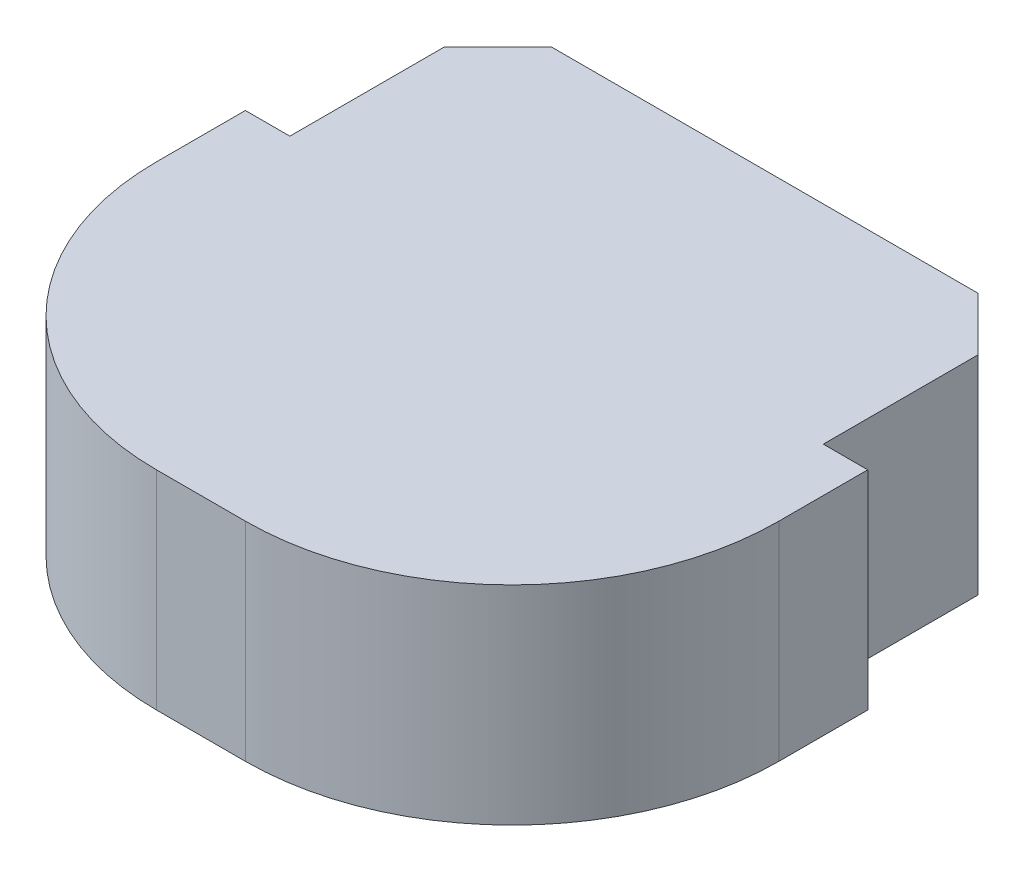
from build123d import *

# Parameters (mm, degrees)
SKETCH1_W           = 8.89
SKETCH1_H           = 5.08
BOSS_EXTRUDE1_DEPTH = 2.9718
SKETCH2_W           = 7.62
SKETCH2_H           = 2.9718
BOSS_EXTRUDE2_DEPTH = 2.9718
CHAMFER1_SIZE       = 0.762
FILLET1_R           = 3.81


with BuildPart() as part:
    # Sketch1 → Boss-Extrude1 (new body)
    with BuildSketch(Plane(origin=(0, 0, 0), x_dir=(1, 0, 0), z_dir=(0, 1, 0))):
        Rectangle(SKETCH1_W, SKETCH1_H)
    extrude(amount=BOSS_EXTRUDE1_DEPTH)

    # Sketch2 → Boss-Extrude2 (add)
    with BuildSketch(Plane(origin=(0, 0, -2.54), x_dir=(-1, 0, 0), z_dir=(0, 0, -1))):
        with Locations((0, 1.4859)):
            Rectangle(SKETCH2_W, SKETCH2_H)
    extrude(amount=BOSS_EXTRUDE2_DEPTH)

    # Chamfer1
    chamfer1_edges = [part.edges().sort_by_distance(p)[0] for p in [
        (-3.81, 1.4859, -5.5118),
        (3.81, 1.4859, -5.5118),
    ]]
    chamfer(chamfer1_edges, length=CHAMFER1_SIZE)

    # Fillet1
    fillet1_edges = [part.edges().sort_by_distance(p)[0] for p in [
        (4.445, 1.4859, 2.54),
        (-4.445, 1.4859, 2.54),
    ]]
    fillet(fillet1_edges, radius=FILLET1_R)


solid = part.part
